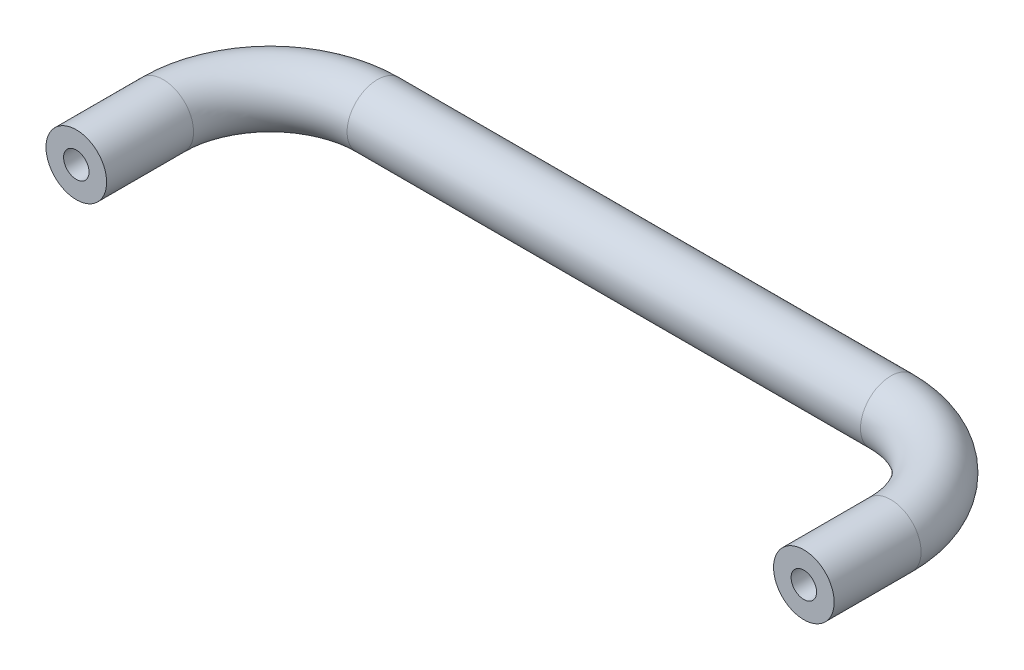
from build123d import *

# Parameters (mm, degrees)
SKETCH2_R                   = 5
TAP_DRILL_FOR_M5_TAP1_D     = 4.2
TAP_DRILL_FOR_M5_TAP1_DEPTH = 15
TAP_DRILL_FOR_M5_TAP1_TIP   = 1.2618073


with BuildPart() as part:
    # Sweep1: sweep along a path in Sketch1
    with BuildLine(Plane(origin=(0, 0, 0), x_dir=(1, 0, 0), z_dir=(0, 1, 0))) as sweep1_path:
        Line((60, -32), (60, -17.65973535))
        ThreePointArc((60, -17.65973535), (54.82758327, -5.17241673), (42.34026465, 0))
        Line((42.34026465, 0), (-42.34026465, 0))
        ThreePointArc((-42.34026465, 0), (-54.82758327, -5.17241673), (-60, -17.65973535))
        Line((-60, -17.65973535), (-60, -32))
    # Sketch2 → Sweep1 (sweep)
    with BuildSketch(Plane(origin=(-60, 0, 32), x_dir=(-1, 0, 0), z_dir=(0, 0, -1))):
        Circle(SKETCH2_R)
    sweep(path=sweep1_path.line)

    # Tap Drill for M5 Tap1
    with Locations(Plane.XY.offset(32)):
        with Locations((-60, 0), (60, 0)):
            Hole(TAP_DRILL_FOR_M5_TAP1_D / 2, depth=TAP_DRILL_FOR_M5_TAP1_DEPTH)
            with Locations((0, 0, -(TAP_DRILL_FOR_M5_TAP1_DEPTH + TAP_DRILL_FOR_M5_TAP1_TIP / 2))):  # 118° drill point
                Cone(0, TAP_DRILL_FOR_M5_TAP1_D / 2, TAP_DRILL_FOR_M5_TAP1_TIP, mode=Mode.SUBTRACT)


solid = part.part
